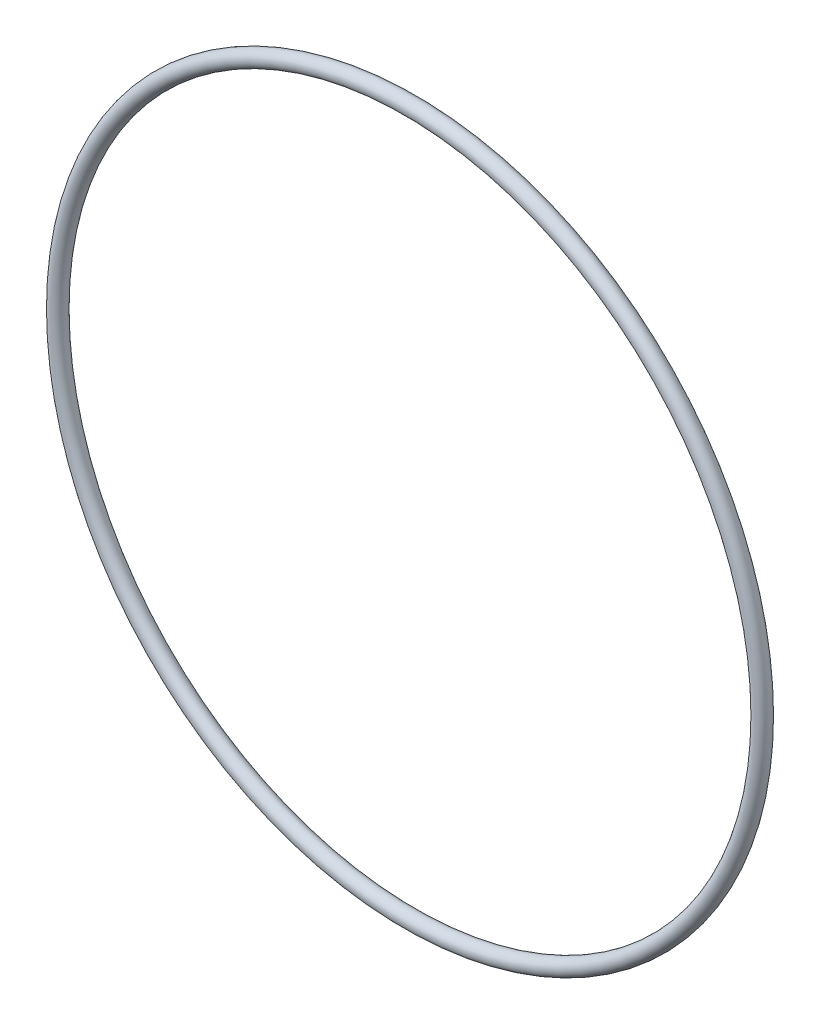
from build123d import *

# Parameters (mm, degrees)
SKETCH2_R = 1.7653


with BuildPart() as part:
    # Sketch2 → Revolve1 (revolve)
    with BuildSketch(Plane(origin=(0, 0, 0), x_dir=(0, 0, -1), z_dir=(1, 0, 0)), mode=Mode.PRIVATE) as revolve1_sk:
        with Locations((0, 77.7621)):
            Circle(SKETCH2_R)
    revolve(revolve1_sk.sketch.rotate(Axis((0, 0, 11.250602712), (0, 0, -1)), 90), axis=Axis((0, 0, 11.250602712), (0, 0, -1)))


solid = part.part
